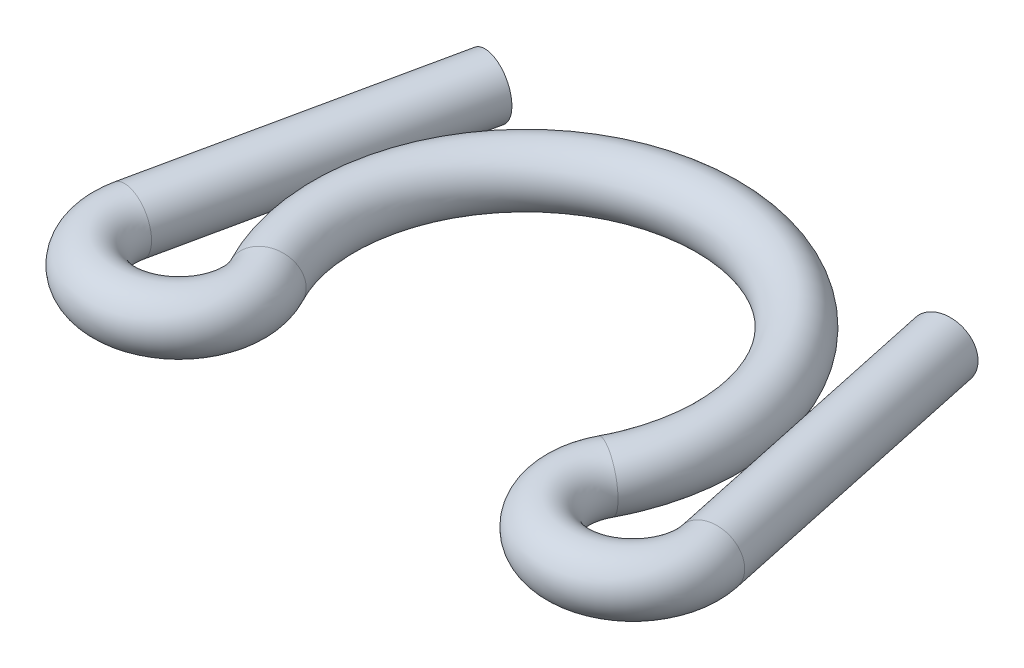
from build123d import *

# Parameters (mm, degrees)
SKETCH2_R = 4.210727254


with BuildPart() as part:
    # Sweep3: sweep along a path in Sketch1
    with BuildLine(Plane(origin=(0, 0, 0), x_dir=(1, 0, 0), z_dir=(0, 1, 0))) as sweep3_path:
        Line((-32.687373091, 33.043447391), (-41.828896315, -9.708271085))
        ThreePointArc((-41.828896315, -9.708271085), (-31.409145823, -20.923358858), (-24.417217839, -7.304903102))
        ThreePointArc((-24.417217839, -7.304903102), (0, 33.162133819), (24.417217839, -7.304903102))
        ThreePointArc((24.417217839, -7.304903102), (31.409145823, -20.923358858), (41.828896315, -9.708271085))
        Line((41.828896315, -9.708271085), (32.687373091, 33.043447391))
    # Sketch2 → Sweep3 (sweep)
    with BuildSketch(Plane(origin=(-32.687373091, 0, -33.043447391), x_dir=(0.9778939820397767, 0, 0.20910131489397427), z_dir=(-0.20910131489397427, 0, 0.9778939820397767))):
        Circle(SKETCH2_R)
    sweep(path=sweep3_path.line)


solid = part.part
